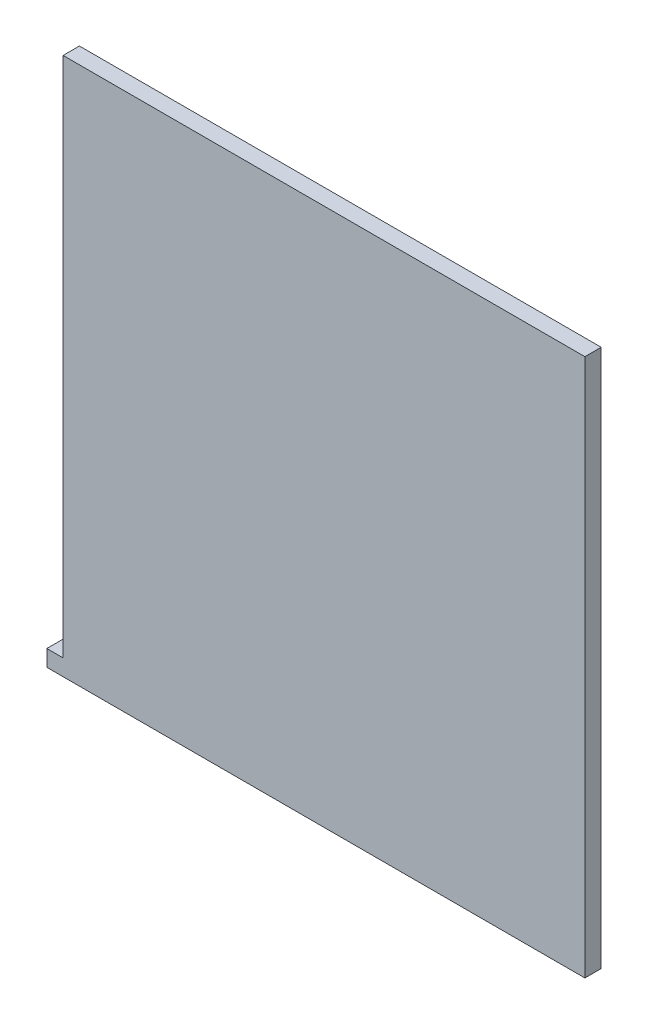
ISO-10303-21;
HEADER;
FILE_DESCRIPTION(('STEP AP214'),'2;1');
FILE_NAME('part.step','',(''),(''),'','','');
FILE_SCHEMA(('AUTOMOTIVE_DESIGN { 1 0 10303 214 1 1 1 1 }'));
ENDSEC;
DATA;
#1=APPLICATION_CONTEXT('core data for automotive mechanical design processes');
#2=APPLICATION_PROTOCOL_DEFINITION('international standard','automotive_design',2000,#1);
#3=PRODUCT_CONTEXT('',#1,'mechanical');
#4=PRODUCT('Part','Part','',(#3));
#5=PRODUCT_RELATED_PRODUCT_CATEGORY('part','',(#4));
#6=PRODUCT_DEFINITION_FORMATION('','',#4);
#7=PRODUCT_DEFINITION_CONTEXT('part definition',#1,'design');
#8=PRODUCT_DEFINITION('design','',#6,#7);
#9=PRODUCT_DEFINITION_SHAPE('','',#8);
#10=(LENGTH_UNIT() NAMED_UNIT(*) SI_UNIT(.MILLI.,.METRE.));
#11=(NAMED_UNIT(*) PLANE_ANGLE_UNIT() SI_UNIT($,.RADIAN.));
#12=(NAMED_UNIT(*) SI_UNIT($,.STERADIAN.) SOLID_ANGLE_UNIT());
#13=UNCERTAINTY_MEASURE_WITH_UNIT(LENGTH_MEASURE(1.E-05),#10,'distance_accuracy_value','');
#14=(GEOMETRIC_REPRESENTATION_CONTEXT(3) GLOBAL_UNCERTAINTY_ASSIGNED_CONTEXT((#13)) GLOBAL_UNIT_ASSIGNED_CONTEXT((#10,
#11,#12)) REPRESENTATION_CONTEXT('',''));
#15=CARTESIAN_POINT('',(0.,0.,0.));
#16=DIRECTION('',(0.,0.,1.));
#17=DIRECTION('',(1.,0.,0.));
#18=AXIS2_PLACEMENT_3D('',#15,#16,#17);
#19=CARTESIAN_POINT('',(-215.9,-209.55,12.7));
#20=DIRECTION('',(0.,1.,0.));
#21=DIRECTION('',(0.,0.,1.));
#22=AXIS2_PLACEMENT_3D('',#19,#20,#21);
#23=PLANE('',#22);
#24=DIRECTION('',(1.,0.,0.));
#25=VECTOR('',#24,1.);
#26=CARTESIAN_POINT('',(-215.9,-209.55,0.));
#27=LINE('',#26,#25);
#28=CARTESIAN_POINT('',(-215.9,-209.55,0.));
#29=VERTEX_POINT('',#28);
#30=CARTESIAN_POINT('',(203.2,-209.55,0.));
#31=VERTEX_POINT('',#30);
#32=EDGE_CURVE('E117',#29,#31,#27,.T.);
#33=ORIENTED_EDGE('',*,*,#32,.T.);
#34=DIRECTION('',(0.,0.,-1.));
#35=VECTOR('',#34,1.);
#36=CARTESIAN_POINT('',(203.2,-209.55,12.7));
#37=LINE('',#36,#35);
#38=CARTESIAN_POINT('',(203.2,-209.55,12.7));
#39=VERTEX_POINT('',#38);
#40=EDGE_CURVE('E11',#39,#31,#37,.T.);
#41=ORIENTED_EDGE('',*,*,#40,.F.);
#42=DIRECTION('',(1.,0.,0.));
#43=VECTOR('',#42,1.);
#44=CARTESIAN_POINT('',(-215.9,-209.55,12.7));
#45=LINE('',#44,#43);
#46=CARTESIAN_POINT('',(-215.9,-209.55,12.7));
#47=VERTEX_POINT('',#46);
#48=EDGE_CURVE('E127',#47,#39,#45,.T.);
#49=ORIENTED_EDGE('',*,*,#48,.F.);
#50=DIRECTION('',(0.,0.,-1.));
#51=VECTOR('',#50,1.);
#52=CARTESIAN_POINT('',(-215.9,-209.55,12.7));
#53=LINE('',#52,#51);
#54=EDGE_CURVE('E113',#47,#29,#53,.T.);
#55=ORIENTED_EDGE('',*,*,#54,.T.);
#56=EDGE_LOOP('',(#33,#41,#49,#55));
#57=FACE_BOUND('',#56,.T.);
#58=ADVANCED_FACE('F33',(#57),#23,.F.);
#59=CARTESIAN_POINT('',(203.2,209.55,12.7));
#60=DIRECTION('',(-1.,0.,0.));
#61=DIRECTION('',(0.,-1.,0.));
#62=AXIS2_PLACEMENT_3D('',#59,#60,#61);
#63=PLANE('',#62);
#64=DIRECTION('',(0.,1.,0.));
#65=VECTOR('',#64,1.);
#66=CARTESIAN_POINT('',(203.2,209.55,0.));
#67=LINE('',#66,#65);
#68=CARTESIAN_POINT('',(203.2,209.55,0.));
#69=VERTEX_POINT('',#68);
#70=EDGE_CURVE('E120',#31,#69,#67,.T.);
#71=ORIENTED_EDGE('',*,*,#70,.T.);
#72=DIRECTION('',(0.,0.,-1.));
#73=VECTOR('',#72,1.);
#74=CARTESIAN_POINT('',(203.2,209.55,12.7));
#75=LINE('',#74,#73);
#76=CARTESIAN_POINT('',(203.2,209.55,12.7));
#77=VERTEX_POINT('',#76);
#78=EDGE_CURVE('E41',#77,#69,#75,.T.);
#79=ORIENTED_EDGE('',*,*,#78,.F.);
#80=DIRECTION('',(0.,1.,0.));
#81=VECTOR('',#80,1.);
#82=CARTESIAN_POINT('',(203.2,-209.55,12.7));
#83=LINE('',#82,#81);
#84=EDGE_CURVE('E86',#39,#77,#83,.T.);
#85=ORIENTED_EDGE('',*,*,#84,.F.);
#86=ORIENTED_EDGE('',*,*,#40,.T.);
#87=EDGE_LOOP('',(#71,#79,#85,#86));
#88=FACE_BOUND('',#87,.T.);
#89=ADVANCED_FACE('F151',(#88),#63,.F.);
#90=CARTESIAN_POINT('',(-203.2,209.55,12.7));
#91=DIRECTION('',(0.,-1.,0.));
#92=DIRECTION('',(0.,0.,-1.));
#93=AXIS2_PLACEMENT_3D('',#90,#91,#92);
#94=PLANE('',#93);
#95=DIRECTION('',(-1.,0.,0.));
#96=VECTOR('',#95,1.);
#97=CARTESIAN_POINT('',(-203.2,209.55,0.));
#98=LINE('',#97,#96);
#99=CARTESIAN_POINT('',(-203.2,209.55,0.));
#100=VERTEX_POINT('',#99);
#101=EDGE_CURVE('E122',#69,#100,#98,.T.);
#102=ORIENTED_EDGE('',*,*,#101,.T.);
#103=DIRECTION('',(0.,0.,-1.));
#104=VECTOR('',#103,1.);
#105=CARTESIAN_POINT('',(-203.2,209.55,12.7));
#106=LINE('',#105,#104);
#107=CARTESIAN_POINT('',(-203.2,209.55,12.7));
#108=VERTEX_POINT('',#107);
#109=EDGE_CURVE('E108',#108,#100,#106,.T.);
#110=ORIENTED_EDGE('',*,*,#109,.F.);
#111=DIRECTION('',(-1.,0.,0.));
#112=VECTOR('',#111,1.);
#113=CARTESIAN_POINT('',(-203.2,209.55,12.7));
#114=LINE('',#113,#112);
#115=EDGE_CURVE('E99',#77,#108,#114,.T.);
#116=ORIENTED_EDGE('',*,*,#115,.F.);
#117=ORIENTED_EDGE('',*,*,#78,.T.);
#118=EDGE_LOOP('',(#102,#110,#116,#117));
#119=FACE_BOUND('',#118,.T.);
#120=ADVANCED_FACE('F133',(#119),#94,.F.);
#121=CARTESIAN_POINT('',(-203.2,209.55,12.7));
#122=DIRECTION('',(1.,0.,0.));
#123=DIRECTION('',(0.,1.,0.));
#124=AXIS2_PLACEMENT_3D('',#121,#122,#123);
#125=PLANE('',#124);
#126=DIRECTION('',(0.,-1.,0.));
#127=VECTOR('',#126,1.);
#128=CARTESIAN_POINT('',(-203.2,209.55,0.));
#129=LINE('',#128,#127);
#130=CARTESIAN_POINT('',(-203.2,-196.85,0.));
#131=VERTEX_POINT('',#130);
#132=EDGE_CURVE('E107',#100,#131,#129,.T.);
#133=ORIENTED_EDGE('',*,*,#132,.T.);
#134=DIRECTION('',(0.,0.,-1.));
#135=VECTOR('',#134,1.);
#136=CARTESIAN_POINT('',(-203.2,-196.85,12.7));
#137=LINE('',#136,#135);
#138=CARTESIAN_POINT('',(-203.2,-196.85,12.7));
#139=VERTEX_POINT('',#138);
#140=EDGE_CURVE('E104',#139,#131,#137,.T.);
#141=ORIENTED_EDGE('',*,*,#140,.F.);
#142=DIRECTION('',(0.,-1.,0.));
#143=VECTOR('',#142,1.);
#144=CARTESIAN_POINT('',(-203.2,209.55,12.7));
#145=LINE('',#144,#143);
#146=EDGE_CURVE('E93',#108,#139,#145,.T.);
#147=ORIENTED_EDGE('',*,*,#146,.F.);
#148=ORIENTED_EDGE('',*,*,#109,.T.);
#149=EDGE_LOOP('',(#133,#141,#147,#148));
#150=FACE_BOUND('',#149,.T.);
#151=ADVANCED_FACE('F105',(#150),#125,.F.);
#152=CARTESIAN_POINT('',(-215.9,-196.85,12.7));
#153=DIRECTION('',(0.,-1.,0.));
#154=DIRECTION('',(0.,0.,-1.));
#155=AXIS2_PLACEMENT_3D('',#152,#153,#154);
#156=PLANE('',#155);
#157=DIRECTION('',(-1.,0.,0.));
#158=VECTOR('',#157,1.);
#159=CARTESIAN_POINT('',(-215.9,-196.85,0.));
#160=LINE('',#159,#158);
#161=CARTESIAN_POINT('',(-215.9,-196.85,0.));
#162=VERTEX_POINT('',#161);
#163=EDGE_CURVE('E72',#131,#162,#160,.T.);
#164=ORIENTED_EDGE('',*,*,#163,.T.);
#165=DIRECTION('',(0.,0.,-1.));
#166=VECTOR('',#165,1.);
#167=CARTESIAN_POINT('',(-215.9,-196.85,12.7));
#168=LINE('',#167,#166);
#169=CARTESIAN_POINT('',(-215.9,-196.85,12.7));
#170=VERTEX_POINT('',#169);
#171=EDGE_CURVE('E109',#170,#162,#168,.T.);
#172=ORIENTED_EDGE('',*,*,#171,.F.);
#173=DIRECTION('',(-1.,0.,0.));
#174=VECTOR('',#173,1.);
#175=CARTESIAN_POINT('',(-215.9,-196.85,12.7));
#176=LINE('',#175,#174);
#177=EDGE_CURVE('E97',#139,#170,#176,.T.);
#178=ORIENTED_EDGE('',*,*,#177,.F.);
#179=ORIENTED_EDGE('',*,*,#140,.T.);
#180=EDGE_LOOP('',(#164,#172,#178,#179));
#181=FACE_BOUND('',#180,.T.);
#182=ADVANCED_FACE('F111',(#181),#156,.F.);
#183=CARTESIAN_POINT('',(-215.9,-209.55,12.7));
#184=DIRECTION('',(1.,0.,0.));
#185=DIRECTION('',(0.,1.,0.));
#186=AXIS2_PLACEMENT_3D('',#183,#184,#185);
#187=PLANE('',#186);
#188=DIRECTION('',(0.,-1.,0.));
#189=VECTOR('',#188,1.);
#190=CARTESIAN_POINT('',(-215.9,-209.55,0.));
#191=LINE('',#190,#189);
#192=EDGE_CURVE('E78',#162,#29,#191,.T.);
#193=ORIENTED_EDGE('',*,*,#192,.T.);
#194=ORIENTED_EDGE('',*,*,#54,.F.);
#195=DIRECTION('',(0.,-1.,0.));
#196=VECTOR('',#195,1.);
#197=CARTESIAN_POINT('',(-215.9,-209.55,12.7));
#198=LINE('',#197,#196);
#199=EDGE_CURVE('E49',#170,#47,#198,.T.);
#200=ORIENTED_EDGE('',*,*,#199,.F.);
#201=ORIENTED_EDGE('',*,*,#171,.T.);
#202=EDGE_LOOP('',(#193,#194,#200,#201));
#203=FACE_BOUND('',#202,.T.);
#204=ADVANCED_FACE('F140',(#203),#187,.F.);
#205=CARTESIAN_POINT('',(203.2,-209.55,12.7));
#206=DIRECTION('',(0.,0.,1.));
#207=DIRECTION('',(1.,0.,0.));
#208=AXIS2_PLACEMENT_3D('',#205,#206,#207);
#209=PLANE('',#208);
#210=ORIENTED_EDGE('',*,*,#48,.T.);
#211=ORIENTED_EDGE('',*,*,#84,.T.);
#212=ORIENTED_EDGE('',*,*,#115,.T.);
#213=ORIENTED_EDGE('',*,*,#146,.T.);
#214=ORIENTED_EDGE('',*,*,#177,.T.);
#215=ORIENTED_EDGE('',*,*,#199,.T.);
#216=EDGE_LOOP('',(#210,#211,#212,#213,#214,#215));
#217=FACE_BOUND('',#216,.T.);
#218=ADVANCED_FACE('F95',(#217),#209,.T.);
#219=CARTESIAN_POINT('',(203.2,-209.55,0.));
#220=DIRECTION('',(0.,0.,1.));
#221=DIRECTION('',(1.,0.,0.));
#222=AXIS2_PLACEMENT_3D('',#219,#220,#221);
#223=PLANE('',#222);
#224=ORIENTED_EDGE('',*,*,#32,.F.);
#225=ORIENTED_EDGE('',*,*,#192,.F.);
#226=ORIENTED_EDGE('',*,*,#163,.F.);
#227=ORIENTED_EDGE('',*,*,#132,.F.);
#228=ORIENTED_EDGE('',*,*,#101,.F.);
#229=ORIENTED_EDGE('',*,*,#70,.F.);
#230=EDGE_LOOP('',(#224,#225,#226,#227,#228,#229));
#231=FACE_BOUND('',#230,.T.);
#232=ADVANCED_FACE('F136',(#231),#223,.F.);
#233=CLOSED_SHELL('',(#58,#89,#120,#151,#182,#204,#218,#232));
#234=MANIFOLD_SOLID_BREP('B2',#233);
#235=ADVANCED_BREP_SHAPE_REPRESENTATION('',(#18,#234),#14);
#236=SHAPE_DEFINITION_REPRESENTATION(#9,#235);
ENDSEC;
END-ISO-10303-21;
